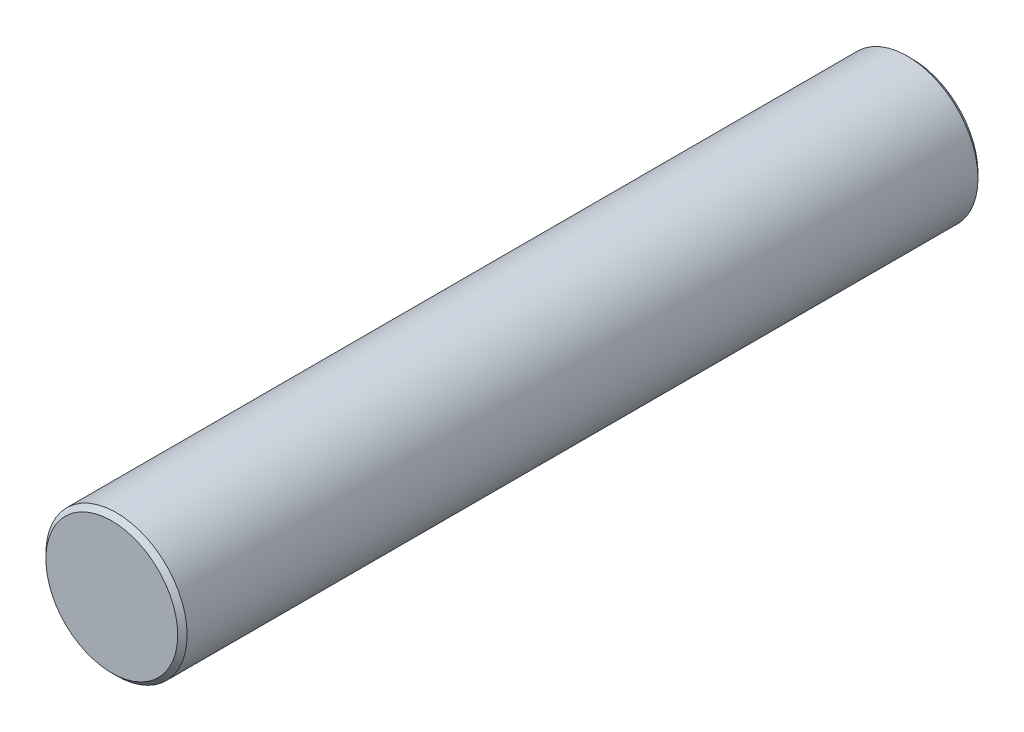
from build123d import *

# Parameters (mm, degrees)
ESQUISSE1_R      = 15
EXTRUSION1_DEPTH = 170
CHANFREIN1_SIZE  = 1


with BuildPart() as part:
    # Esquisse1 → Extrusion1 (new body)
    with BuildSketch(Plane.XY):
        Circle(ESQUISSE1_R)
    extrude(amount=EXTRUSION1_DEPTH)

    # Chanfrein1
    chanfrein1_edges = [part.edges().sort_by_distance(p)[0] for p in [
        (-15, 0, 0),
        (-15, 0, 170),
    ]]
    chamfer(chanfrein1_edges, length=CHANFREIN1_SIZE)


solid = part.part
